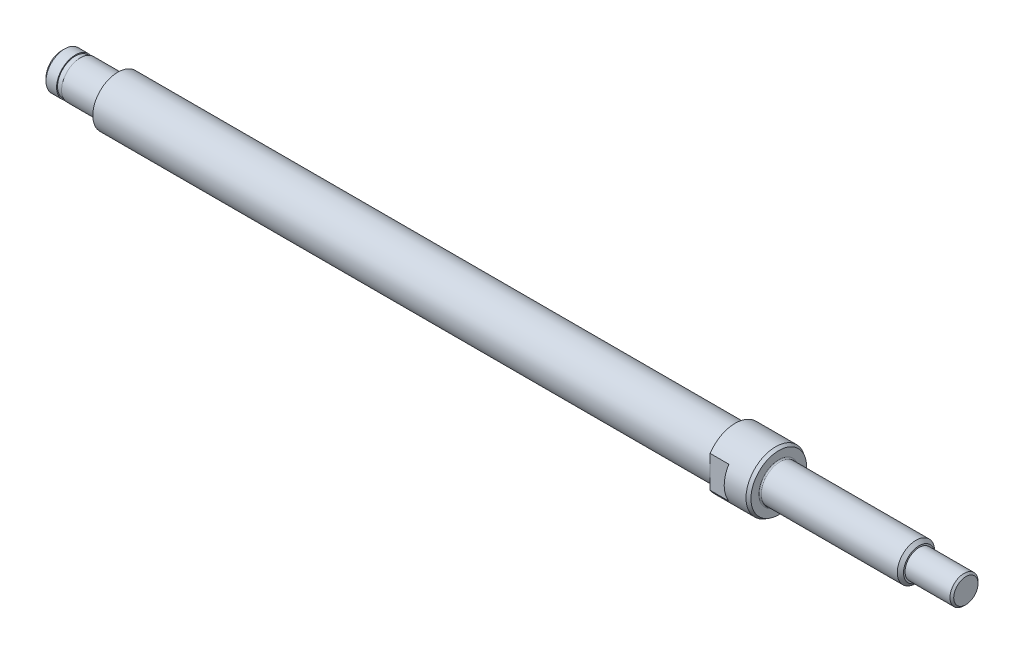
ISO-10303-21;
HEADER;
FILE_DESCRIPTION(('STEP AP214'),'2;1');
FILE_NAME('part.step','',(''),(''),'','','');
FILE_SCHEMA(('AUTOMOTIVE_DESIGN { 1 0 10303 214 1 1 1 1 }'));
ENDSEC;
DATA;
#1=APPLICATION_CONTEXT('core data for automotive mechanical design processes');
#2=APPLICATION_PROTOCOL_DEFINITION('international standard','automotive_design',2000,#1);
#3=PRODUCT_CONTEXT('',#1,'mechanical');
#4=PRODUCT('Part','Part','',(#3));
#5=PRODUCT_RELATED_PRODUCT_CATEGORY('part','',(#4));
#6=PRODUCT_DEFINITION_FORMATION('','',#4);
#7=PRODUCT_DEFINITION_CONTEXT('part definition',#1,'design');
#8=PRODUCT_DEFINITION('design','',#6,#7);
#9=PRODUCT_DEFINITION_SHAPE('','',#8);
#10=(LENGTH_UNIT() NAMED_UNIT(*) SI_UNIT(.MILLI.,.METRE.));
#11=(NAMED_UNIT(*) PLANE_ANGLE_UNIT() SI_UNIT($,.RADIAN.));
#12=(NAMED_UNIT(*) SI_UNIT($,.STERADIAN.) SOLID_ANGLE_UNIT());
#13=UNCERTAINTY_MEASURE_WITH_UNIT(LENGTH_MEASURE(1.E-05),#10,'distance_accuracy_value','');
#14=(GEOMETRIC_REPRESENTATION_CONTEXT(3) GLOBAL_UNCERTAINTY_ASSIGNED_CONTEXT((#13)) GLOBAL_UNIT_ASSIGNED_CONTEXT((#10,
#11,#12)) REPRESENTATION_CONTEXT('',''));
#15=CARTESIAN_POINT('',(0.,0.,0.));
#16=DIRECTION('',(0.,0.,1.));
#17=DIRECTION('',(1.,0.,0.));
#18=AXIS2_PLACEMENT_3D('',#15,#16,#17);
#19=CARTESIAN_POINT('',(136.,0.,0.));
#20=DIRECTION('',(-1.,0.,0.));
#21=DIRECTION('',(0.,0.,1.));
#22=AXIS2_PLACEMENT_3D('',#19,#20,#21);
#23=CYLINDRICAL_SURFACE('',#22,4.75);
#24=CARTESIAN_POINT('',(105.5,0.,0.));
#25=DIRECTION('',(-1.,0.,0.));
#26=DIRECTION('',(0.,0.,1.));
#27=AXIS2_PLACEMENT_3D('',#24,#25,#26);
#28=CIRCLE('',#27,4.75);
#29=CARTESIAN_POINT('',(105.5,0.,4.75));
#30=VERTEX_POINT('',#29);
#31=EDGE_CURVE('E104',#30,#30,#28,.T.);
#32=ORIENTED_EDGE('',*,*,#31,.T.);
#33=EDGE_LOOP('',(#32));
#34=FACE_BOUND('',#33,.T.);
#35=DIRECTION('',(-1.,0.,0.));
#36=VECTOR('',#35,1.);
#37=CARTESIAN_POINT('',(136.,-2.5617376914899,-4.));
#38=LINE('',#37,#36);
#39=CARTESIAN_POINT('',(102.,-2.5617376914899,-4.));
#40=VERTEX_POINT('',#39);
#41=CARTESIAN_POINT('',(99.,-2.5617376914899,-4.));
#42=VERTEX_POINT('',#41);
#43=EDGE_CURVE('E78',#40,#42,#38,.T.);
#44=ORIENTED_EDGE('',*,*,#43,.F.);
#45=CARTESIAN_POINT('',(102.,0.,0.));
#46=DIRECTION('',(1.,0.,0.));
#47=DIRECTION('',(0.,0.,-1.));
#48=AXIS2_PLACEMENT_3D('',#45,#46,#47);
#49=CIRCLE('',#48,4.75);
#50=CARTESIAN_POINT('',(102.,2.5617376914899,-4.));
#51=VERTEX_POINT('',#50);
#52=EDGE_CURVE('E11',#40,#51,#49,.T.);
#53=ORIENTED_EDGE('',*,*,#52,.T.);
#54=DIRECTION('',(-1.,0.,0.));
#55=VECTOR('',#54,1.);
#56=CARTESIAN_POINT('',(136.,2.5617376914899,-4.));
#57=LINE('',#56,#55);
#58=CARTESIAN_POINT('',(99.,2.5617376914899,-4.));
#59=VERTEX_POINT('',#58);
#60=EDGE_CURVE('E85',#59,#51,#57,.F.);
#61=ORIENTED_EDGE('',*,*,#60,.F.);
#62=CARTESIAN_POINT('',(99.,0.,0.));
#63=DIRECTION('',(-1.,0.,0.));
#64=DIRECTION('',(0.,0.,1.));
#65=AXIS2_PLACEMENT_3D('',#62,#63,#64);
#66=CIRCLE('',#65,4.75);
#67=CARTESIAN_POINT('',(99.,2.5617376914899,4.));
#68=VERTEX_POINT('',#67);
#69=EDGE_CURVE('E100',#68,#59,#66,.T.);
#70=ORIENTED_EDGE('',*,*,#69,.F.);
#71=DIRECTION('',(-1.,0.,0.));
#72=VECTOR('',#71,1.);
#73=CARTESIAN_POINT('',(136.,2.5617376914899,4.));
#74=LINE('',#73,#72);
#75=CARTESIAN_POINT('',(102.,2.5617376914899,4.));
#76=VERTEX_POINT('',#75);
#77=EDGE_CURVE('E139',#76,#68,#74,.T.);
#78=ORIENTED_EDGE('',*,*,#77,.F.);
#79=CARTESIAN_POINT('',(102.,-2.5617376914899,4.));
#80=VERTEX_POINT('',#79);
#81=EDGE_CURVE('E36',#76,#80,#49,.T.);
#82=ORIENTED_EDGE('',*,*,#81,.T.);
#83=DIRECTION('',(-1.,0.,0.));
#84=VECTOR('',#83,1.);
#85=CARTESIAN_POINT('',(136.,-2.5617376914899,4.));
#86=LINE('',#85,#84);
#87=CARTESIAN_POINT('',(99.,-2.5617376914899,4.));
#88=VERTEX_POINT('',#87);
#89=EDGE_CURVE('E95',#88,#80,#86,.F.);
#90=ORIENTED_EDGE('',*,*,#89,.F.);
#91=EDGE_CURVE('E91',#42,#88,#66,.T.);
#92=ORIENTED_EDGE('',*,*,#91,.F.);
#93=EDGE_LOOP('',(#44,#53,#61,#70,#78,#82,#90,#92));
#94=FACE_BOUND('',#93,.T.);
#95=ADVANCED_FACE('F32',(#34,#94),#23,.T.);
#96=CARTESIAN_POINT('',(99.,4.,0.));
#97=DIRECTION('',(1.,0.,0.));
#98=DIRECTION('',(0.,0.,-1.));
#99=AXIS2_PLACEMENT_3D('',#96,#97,#98);
#100=PLANE('',#99);
#101=DIRECTION('',(0.,1.,0.));
#102=VECTOR('',#101,1.);
#103=CARTESIAN_POINT('',(99.,-4.85,-4.));
#104=LINE('',#103,#102);
#105=CARTESIAN_POINT('',(99.,0.,-4.));
#106=VERTEX_POINT('',#105);
#107=EDGE_CURVE('E47',#42,#106,#104,.T.);
#108=ORIENTED_EDGE('',*,*,#107,.F.);
#109=ORIENTED_EDGE('',*,*,#91,.T.);
#110=DIRECTION('',(0.,-1.,0.));
#111=VECTOR('',#110,1.);
#112=CARTESIAN_POINT('',(99.,4.85,4.));
#113=LINE('',#112,#111);
#114=CARTESIAN_POINT('',(99.,0.,4.));
#115=VERTEX_POINT('',#114);
#116=EDGE_CURVE('E147',#115,#88,#113,.T.);
#117=ORIENTED_EDGE('',*,*,#116,.F.);
#118=CARTESIAN_POINT('',(99.,0.,0.));
#119=DIRECTION('',(-1.,0.,0.));
#120=DIRECTION('',(0.,0.,1.));
#121=AXIS2_PLACEMENT_3D('',#118,#119,#120);
#122=CIRCLE('',#121,4.);
#123=EDGE_CURVE('E93',#106,#115,#122,.T.);
#124=ORIENTED_EDGE('',*,*,#123,.F.);
#125=EDGE_LOOP('',(#108,#109,#117,#124));
#126=FACE_BOUND('',#125,.T.);
#127=ADVANCED_FACE('F90',(#126),#100,.F.);
#128=EDGE_CURVE('E96',#106,#59,#104,.T.);
#129=ORIENTED_EDGE('',*,*,#128,.F.);
#130=EDGE_CURVE('E101',#115,#106,#122,.T.);
#131=ORIENTED_EDGE('',*,*,#130,.F.);
#132=EDGE_CURVE('E55',#68,#115,#113,.T.);
#133=ORIENTED_EDGE('',*,*,#132,.F.);
#134=ORIENTED_EDGE('',*,*,#69,.T.);
#135=EDGE_LOOP('',(#129,#131,#133,#134));
#136=FACE_BOUND('',#135,.T.);
#137=ADVANCED_FACE('F181',(#136),#100,.F.);
#138=CARTESIAN_POINT('',(0.,0.,0.));
#139=DIRECTION('',(1.,0.,0.));
#140=DIRECTION('',(0.,0.,-1.));
#141=AXIS2_PLACEMENT_3D('',#138,#139,#140);
#142=PLANE('',#141);
#143=CARTESIAN_POINT('',(0.,0.,0.));
#144=DIRECTION('',(-1.,0.,0.));
#145=DIRECTION('',(0.,0.,1.));
#146=AXIS2_PLACEMENT_3D('',#143,#144,#145);
#147=CIRCLE('',#146,4.);
#148=CARTESIAN_POINT('',(0.,0.,4.));
#149=VERTEX_POINT('',#148);
#150=EDGE_CURVE('E173',#149,#149,#147,.T.);
#151=ORIENTED_EDGE('',*,*,#150,.T.);
#152=EDGE_LOOP('',(#151));
#153=FACE_BOUND('',#152,.T.);
#154=CARTESIAN_POINT('',(0.,0.,0.));
#155=DIRECTION('',(-1.,0.,0.));
#156=DIRECTION('',(0.,0.,1.));
#157=AXIS2_PLACEMENT_3D('',#154,#155,#156);
#158=CIRCLE('',#157,3.20000000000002);
#159=CARTESIAN_POINT('',(0.,0.,3.20000000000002));
#160=VERTEX_POINT('',#159);
#161=EDGE_CURVE('E133',#160,#160,#158,.T.);
#162=ORIENTED_EDGE('',*,*,#161,.F.);
#163=EDGE_LOOP('',(#162));
#164=FACE_BOUND('',#163,.T.);
#165=ADVANCED_FACE('F236',(#153,#164),#142,.F.);
#166=CARTESIAN_POINT('',(136.,1.95,0.));
#167=DIRECTION('',(-1.,0.,0.));
#168=DIRECTION('',(0.,0.,1.));
#169=AXIS2_PLACEMENT_3D('',#166,#167,#168);
#170=PLANE('',#169);
#171=CARTESIAN_POINT('',(136.,0.,0.));
#172=DIRECTION('',(-1.,0.,0.));
#173=DIRECTION('',(0.,0.,1.));
#174=AXIS2_PLACEMENT_3D('',#171,#172,#173);
#175=CIRCLE('',#174,1.95);
#176=CARTESIAN_POINT('',(136.,0.,1.95));
#177=VERTEX_POINT('',#176);
#178=EDGE_CURVE('E131',#177,#177,#175,.T.);
#179=ORIENTED_EDGE('',*,*,#178,.F.);
#180=EDGE_LOOP('',(#179));
#181=FACE_BOUND('',#180,.T.);
#182=ADVANCED_FACE('F34',(#181),#170,.F.);
#183=CARTESIAN_POINT('',(136.,0.,0.));
#184=DIRECTION('',(-1.,0.,0.));
#185=DIRECTION('',(0.,0.,1.));
#186=AXIS2_PLACEMENT_3D('',#183,#184,#185);
#187=CONICAL_SURFACE('',#186,1.95,0.785398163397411);
#188=CARTESIAN_POINT('',(135.7,0.,0.));
#189=DIRECTION('',(-1.,0.,0.));
#190=DIRECTION('',(0.,0.,1.));
#191=AXIS2_PLACEMENT_3D('',#188,#189,#190);
#192=CIRCLE('',#191,2.25);
#193=CARTESIAN_POINT('',(135.7,0.,2.25));
#194=VERTEX_POINT('',#193);
#195=EDGE_CURVE('E128',#194,#194,#192,.T.);
#196=ORIENTED_EDGE('',*,*,#195,.F.);
#197=EDGE_LOOP('',(#196));
#198=FACE_BOUND('',#197,.T.);
#199=ORIENTED_EDGE('',*,*,#178,.T.);
#200=EDGE_LOOP('',(#199));
#201=FACE_BOUND('',#200,.T.);
#202=ADVANCED_FACE('F229',(#198,#201),#187,.T.);
#203=CARTESIAN_POINT('',(136.,0.,0.));
#204=DIRECTION('',(-1.,0.,0.));
#205=DIRECTION('',(0.,0.,1.));
#206=AXIS2_PLACEMENT_3D('',#203,#204,#205);
#207=CYLINDRICAL_SURFACE('',#206,2.25);
#208=CARTESIAN_POINT('',(128.5,0.,0.));
#209=DIRECTION('',(-1.,0.,0.));
#210=DIRECTION('',(0.,0.,1.));
#211=AXIS2_PLACEMENT_3D('',#208,#209,#210);
#212=CIRCLE('',#211,2.25);
#213=CARTESIAN_POINT('',(128.5,0.,2.25));
#214=VERTEX_POINT('',#213);
#215=EDGE_CURVE('E125',#214,#214,#212,.T.);
#216=ORIENTED_EDGE('',*,*,#215,.F.);
#217=EDGE_LOOP('',(#216));
#218=FACE_BOUND('',#217,.T.);
#219=ORIENTED_EDGE('',*,*,#195,.T.);
#220=EDGE_LOOP('',(#219));
#221=FACE_BOUND('',#220,.T.);
#222=ADVANCED_FACE('F226',(#218,#221),#207,.T.);
#223=CARTESIAN_POINT('',(128.5,2.5,0.));
#224=DIRECTION('',(-1.,0.,0.));
#225=DIRECTION('',(0.,0.,1.));
#226=AXIS2_PLACEMENT_3D('',#223,#224,#225);
#227=PLANE('',#226);
#228=CARTESIAN_POINT('',(128.5,0.,0.));
#229=DIRECTION('',(-1.,0.,0.));
#230=DIRECTION('',(0.,0.,1.));
#231=AXIS2_PLACEMENT_3D('',#228,#229,#230);
#232=CIRCLE('',#231,2.5);
#233=CARTESIAN_POINT('',(128.5,0.,2.5));
#234=VERTEX_POINT('',#233);
#235=EDGE_CURVE('E122',#234,#234,#232,.T.);
#236=ORIENTED_EDGE('',*,*,#235,.F.);
#237=EDGE_LOOP('',(#236));
#238=FACE_BOUND('',#237,.T.);
#239=ORIENTED_EDGE('',*,*,#215,.T.);
#240=EDGE_LOOP('',(#239));
#241=FACE_BOUND('',#240,.T.);
#242=ADVANCED_FACE('F222',(#238,#241),#227,.F.);
#243=CARTESIAN_POINT('',(128.5,0.,0.));
#244=DIRECTION('',(-1.,0.,0.));
#245=DIRECTION('',(0.,0.,1.));
#246=AXIS2_PLACEMENT_3D('',#243,#244,#245);
#247=CONICAL_SURFACE('',#246,2.5,0.785398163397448);
#248=CARTESIAN_POINT('',(128.,0.,0.));
#249=DIRECTION('',(-1.,0.,0.));
#250=DIRECTION('',(0.,0.,1.));
#251=AXIS2_PLACEMENT_3D('',#248,#249,#250);
#252=CIRCLE('',#251,3.);
#253=CARTESIAN_POINT('',(128.,0.,3.));
#254=VERTEX_POINT('',#253);
#255=EDGE_CURVE('E119',#254,#254,#252,.T.);
#256=ORIENTED_EDGE('',*,*,#255,.F.);
#257=EDGE_LOOP('',(#256));
#258=FACE_BOUND('',#257,.T.);
#259=ORIENTED_EDGE('',*,*,#235,.T.);
#260=EDGE_LOOP('',(#259));
#261=FACE_BOUND('',#260,.T.);
#262=ADVANCED_FACE('F218',(#258,#261),#247,.T.);
#263=CARTESIAN_POINT('',(136.,0.,0.));
#264=DIRECTION('',(-1.,0.,0.));
#265=DIRECTION('',(0.,0.,1.));
#266=AXIS2_PLACEMENT_3D('',#263,#264,#265);
#267=CYLINDRICAL_SURFACE('',#266,3.);
#268=CARTESIAN_POINT('',(106.2,0.,0.));
#269=DIRECTION('',(-1.,0.,0.));
#270=DIRECTION('',(0.,0.,1.));
#271=AXIS2_PLACEMENT_3D('',#268,#269,#270);
#272=CIRCLE('',#271,3.);
#273=CARTESIAN_POINT('',(106.2,0.,3.));
#274=VERTEX_POINT('',#273);
#275=EDGE_CURVE('E116',#274,#274,#272,.T.);
#276=ORIENTED_EDGE('',*,*,#275,.F.);
#277=EDGE_LOOP('',(#276));
#278=FACE_BOUND('',#277,.T.);
#279=ORIENTED_EDGE('',*,*,#255,.T.);
#280=EDGE_LOOP('',(#279));
#281=FACE_BOUND('',#280,.T.);
#282=ADVANCED_FACE('F214',(#278,#281),#267,.T.);
#283=CARTESIAN_POINT('',(106.199999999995,0.,0.));
#284=DIRECTION('',(-1.,0.,0.));
#285=DIRECTION('',(0.,0.,1.));
#286=AXIS2_PLACEMENT_3D('',#283,#284,#285);
#287=TOROIDAL_SURFACE('',#286,3.19999999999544,0.19999999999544);
#288=CARTESIAN_POINT('',(106.,0.,0.));
#289=DIRECTION('',(-1.,0.,0.));
#290=DIRECTION('',(0.,0.,1.));
#291=AXIS2_PLACEMENT_3D('',#288,#289,#290);
#292=CIRCLE('',#291,3.2);
#293=CARTESIAN_POINT('',(106.,0.,3.2));
#294=VERTEX_POINT('',#293);
#295=EDGE_CURVE('E113',#294,#294,#292,.T.);
#296=ORIENTED_EDGE('',*,*,#295,.F.);
#297=EDGE_LOOP('',(#296));
#298=FACE_BOUND('',#297,.T.);
#299=ORIENTED_EDGE('',*,*,#275,.T.);
#300=EDGE_LOOP('',(#299));
#301=FACE_BOUND('',#300,.T.);
#302=ADVANCED_FACE('F210',(#298,#301),#287,.F.);
#303=CARTESIAN_POINT('',(106.,4.4613248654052,0.));
#304=DIRECTION('',(-1.,0.,0.));
#305=DIRECTION('',(0.,0.,1.));
#306=AXIS2_PLACEMENT_3D('',#303,#304,#305);
#307=PLANE('',#306);
#308=CARTESIAN_POINT('',(106.,0.,0.));
#309=DIRECTION('',(-1.,0.,0.));
#310=DIRECTION('',(0.,0.,1.));
#311=AXIS2_PLACEMENT_3D('',#308,#309,#310);
#312=CIRCLE('',#311,4.4613248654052);
#313=CARTESIAN_POINT('',(106.,0.,4.4613248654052));
#314=VERTEX_POINT('',#313);
#315=EDGE_CURVE('E110',#314,#314,#312,.T.);
#316=ORIENTED_EDGE('',*,*,#315,.F.);
#317=EDGE_LOOP('',(#316));
#318=FACE_BOUND('',#317,.T.);
#319=ORIENTED_EDGE('',*,*,#295,.T.);
#320=EDGE_LOOP('',(#319));
#321=FACE_BOUND('',#320,.T.);
#322=ADVANCED_FACE('F206',(#318,#321),#307,.F.);
#323=CARTESIAN_POINT('',(106.,0.,0.));
#324=DIRECTION('',(-1.,0.,0.));
#325=DIRECTION('',(0.,0.,1.));
#326=AXIS2_PLACEMENT_3D('',#323,#324,#325);
#327=CONICAL_SURFACE('',#326,4.4613248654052,0.523598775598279);
#328=ORIENTED_EDGE('',*,*,#31,.F.);
#329=EDGE_LOOP('',(#328));
#330=FACE_BOUND('',#329,.T.);
#331=ORIENTED_EDGE('',*,*,#315,.T.);
#332=EDGE_LOOP('',(#331));
#333=FACE_BOUND('',#332,.T.);
#334=ADVANCED_FACE('F203',(#330,#333),#327,.T.);
#335=CARTESIAN_POINT('',(136.,0.,0.));
#336=DIRECTION('',(-1.,0.,0.));
#337=DIRECTION('',(0.,0.,1.));
#338=AXIS2_PLACEMENT_3D('',#335,#336,#337);
#339=CYLINDRICAL_SURFACE('',#338,4.);
#340=ORIENTED_EDGE('',*,*,#150,.F.);
#341=EDGE_LOOP('',(#340));
#342=FACE_BOUND('',#341,.T.);
#343=ORIENTED_EDGE('',*,*,#130,.T.);
#344=ORIENTED_EDGE('',*,*,#123,.T.);
#345=EDGE_LOOP('',(#343,#344));
#346=FACE_BOUND('',#345,.T.);
#347=ADVANCED_FACE('F179',(#342,#346),#339,.T.);
#348=CARTESIAN_POINT('',(-0.200000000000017,0.,0.));
#349=DIRECTION('',(-1.,0.,0.));
#350=DIRECTION('',(0.,0.,1.));
#351=AXIS2_PLACEMENT_3D('',#348,#349,#350);
#352=TOROIDAL_SURFACE('',#351,3.20000000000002,0.200000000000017);
#353=CARTESIAN_POINT('',(-0.2,0.,0.));
#354=DIRECTION('',(-1.,0.,0.));
#355=DIRECTION('',(0.,0.,1.));
#356=AXIS2_PLACEMENT_3D('',#353,#354,#355);
#357=CIRCLE('',#356,3.);
#358=CARTESIAN_POINT('',(-0.2,0.,3.));
#359=VERTEX_POINT('',#358);
#360=EDGE_CURVE('E171',#359,#359,#357,.T.);
#361=ORIENTED_EDGE('',*,*,#360,.F.);
#362=EDGE_LOOP('',(#361));
#363=FACE_BOUND('',#362,.T.);
#364=ORIENTED_EDGE('',*,*,#161,.T.);
#365=EDGE_LOOP('',(#364));
#366=FACE_BOUND('',#365,.T.);
#367=ADVANCED_FACE('F251',(#363,#366),#352,.F.);
#368=CARTESIAN_POINT('',(0.,0.,0.));
#369=DIRECTION('',(-1.,0.,0.));
#370=DIRECTION('',(0.,0.,1.));
#371=AXIS2_PLACEMENT_3D('',#368,#369,#370);
#372=CYLINDRICAL_SURFACE('',#371,3.);
#373=CARTESIAN_POINT('',(-6.,0.,0.));
#374=DIRECTION('',(-1.,0.,0.));
#375=DIRECTION('',(0.,0.,1.));
#376=AXIS2_PLACEMENT_3D('',#373,#374,#375);
#377=CIRCLE('',#376,3.);
#378=CARTESIAN_POINT('',(-6.,0.,3.));
#379=VERTEX_POINT('',#378);
#380=EDGE_CURVE('E168',#379,#379,#377,.T.);
#381=ORIENTED_EDGE('',*,*,#380,.F.);
#382=EDGE_LOOP('',(#381));
#383=FACE_BOUND('',#382,.T.);
#384=ORIENTED_EDGE('',*,*,#360,.T.);
#385=EDGE_LOOP('',(#384));
#386=FACE_BOUND('',#385,.T.);
#387=ADVANCED_FACE('F258',(#383,#386),#372,.T.);
#388=CARTESIAN_POINT('',(-6.,2.85,0.));
#389=DIRECTION('',(1.,0.,0.));
#390=DIRECTION('',(0.,0.,-1.));
#391=AXIS2_PLACEMENT_3D('',#388,#389,#390);
#392=PLANE('',#391);
#393=CARTESIAN_POINT('',(-6.,0.,0.));
#394=DIRECTION('',(-1.,0.,0.));
#395=DIRECTION('',(0.,0.,1.));
#396=AXIS2_PLACEMENT_3D('',#393,#394,#395);
#397=CIRCLE('',#396,2.85);
#398=CARTESIAN_POINT('',(-6.,0.,2.85));
#399=VERTEX_POINT('',#398);
#400=EDGE_CURVE('E165',#399,#399,#397,.T.);
#401=ORIENTED_EDGE('',*,*,#400,.F.);
#402=EDGE_LOOP('',(#401));
#403=FACE_BOUND('',#402,.T.);
#404=ORIENTED_EDGE('',*,*,#380,.T.);
#405=EDGE_LOOP('',(#404));
#406=FACE_BOUND('',#405,.T.);
#407=ADVANCED_FACE('F263',(#403,#406),#392,.F.);
#408=CARTESIAN_POINT('',(0.,0.,0.));
#409=DIRECTION('',(-1.,0.,0.));
#410=DIRECTION('',(0.,0.,1.));
#411=AXIS2_PLACEMENT_3D('',#408,#409,#410);
#412=CYLINDRICAL_SURFACE('',#411,2.85);
#413=CARTESIAN_POINT('',(-6.8,0.,0.));
#414=DIRECTION('',(-1.,0.,0.));
#415=DIRECTION('',(0.,0.,1.));
#416=AXIS2_PLACEMENT_3D('',#413,#414,#415);
#417=CIRCLE('',#416,2.85);
#418=CARTESIAN_POINT('',(-6.8,0.,2.85));
#419=VERTEX_POINT('',#418);
#420=EDGE_CURVE('E162',#419,#419,#417,.T.);
#421=ORIENTED_EDGE('',*,*,#420,.F.);
#422=EDGE_LOOP('',(#421));
#423=FACE_BOUND('',#422,.T.);
#424=ORIENTED_EDGE('',*,*,#400,.T.);
#425=EDGE_LOOP('',(#424));
#426=FACE_BOUND('',#425,.T.);
#427=ADVANCED_FACE('F270',(#423,#426),#412,.T.);
#428=CARTESIAN_POINT('',(-6.8,3.,0.));
#429=DIRECTION('',(-1.,0.,0.));
#430=DIRECTION('',(0.,0.,1.));
#431=AXIS2_PLACEMENT_3D('',#428,#429,#430);
#432=PLANE('',#431);
#433=CARTESIAN_POINT('',(-6.8,0.,0.));
#434=DIRECTION('',(-1.,0.,0.));
#435=DIRECTION('',(0.,0.,1.));
#436=AXIS2_PLACEMENT_3D('',#433,#434,#435);
#437=CIRCLE('',#436,3.);
#438=CARTESIAN_POINT('',(-6.8,0.,3.));
#439=VERTEX_POINT('',#438);
#440=EDGE_CURVE('E159',#439,#439,#437,.T.);
#441=ORIENTED_EDGE('',*,*,#440,.F.);
#442=EDGE_LOOP('',(#441));
#443=FACE_BOUND('',#442,.T.);
#444=ORIENTED_EDGE('',*,*,#420,.T.);
#445=EDGE_LOOP('',(#444));
#446=FACE_BOUND('',#445,.T.);
#447=ADVANCED_FACE('F277',(#443,#446),#432,.F.);
#448=CARTESIAN_POINT('',(0.,0.,0.));
#449=DIRECTION('',(-1.,0.,0.));
#450=DIRECTION('',(0.,0.,1.));
#451=AXIS2_PLACEMENT_3D('',#448,#449,#450);
#452=CYLINDRICAL_SURFACE('',#451,3.);
#453=CARTESIAN_POINT('',(-8.5,0.,0.));
#454=DIRECTION('',(-1.,0.,0.));
#455=DIRECTION('',(0.,0.,1.));
#456=AXIS2_PLACEMENT_3D('',#453,#454,#455);
#457=CIRCLE('',#456,3.);
#458=CARTESIAN_POINT('',(-8.5,0.,3.));
#459=VERTEX_POINT('',#458);
#460=EDGE_CURVE('E156',#459,#459,#457,.T.);
#461=ORIENTED_EDGE('',*,*,#460,.F.);
#462=EDGE_LOOP('',(#461));
#463=FACE_BOUND('',#462,.T.);
#464=ORIENTED_EDGE('',*,*,#440,.T.);
#465=EDGE_LOOP('',(#464));
#466=FACE_BOUND('',#465,.T.);
#467=ADVANCED_FACE('F281',(#463,#466),#452,.T.);
#468=CARTESIAN_POINT('',(-8.5,0.,0.));
#469=DIRECTION('',(1.,0.,0.));
#470=DIRECTION('',(0.,0.,-1.));
#471=AXIS2_PLACEMENT_3D('',#468,#469,#470);
#472=CONICAL_SURFACE('',#471,3.,0.78539816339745);
#473=CARTESIAN_POINT('',(-9.,0.,0.));
#474=DIRECTION('',(-1.,0.,0.));
#475=DIRECTION('',(0.,0.,1.));
#476=AXIS2_PLACEMENT_3D('',#473,#474,#475);
#477=CIRCLE('',#476,2.5);
#478=CARTESIAN_POINT('',(-9.,0.,2.5));
#479=VERTEX_POINT('',#478);
#480=EDGE_CURVE('E84',#479,#479,#477,.T.);
#481=ORIENTED_EDGE('',*,*,#480,.F.);
#482=EDGE_LOOP('',(#481));
#483=FACE_BOUND('',#482,.T.);
#484=ORIENTED_EDGE('',*,*,#460,.T.);
#485=EDGE_LOOP('',(#484));
#486=FACE_BOUND('',#485,.T.);
#487=ADVANCED_FACE('F285',(#483,#486),#472,.T.);
#488=CARTESIAN_POINT('',(-9.,0.,0.));
#489=DIRECTION('',(1.,0.,0.));
#490=DIRECTION('',(0.,0.,-1.));
#491=AXIS2_PLACEMENT_3D('',#488,#489,#490);
#492=PLANE('',#491);
#493=ORIENTED_EDGE('',*,*,#480,.T.);
#494=EDGE_LOOP('',(#493));
#495=FACE_BOUND('',#494,.T.);
#496=ADVANCED_FACE('F288',(#495),#492,.F.);
#497=CARTESIAN_POINT('',(99.,4.85,4.));
#498=DIRECTION('',(0.,0.,1.));
#499=DIRECTION('',(1.,0.,0.));
#500=AXIS2_PLACEMENT_3D('',#497,#498,#499);
#501=PLANE('',#500);
#502=ORIENTED_EDGE('',*,*,#77,.T.);
#503=ORIENTED_EDGE('',*,*,#132,.T.);
#504=ORIENTED_EDGE('',*,*,#116,.T.);
#505=ORIENTED_EDGE('',*,*,#89,.T.);
#506=DIRECTION('',(0.,-1.,0.));
#507=VECTOR('',#506,1.);
#508=CARTESIAN_POINT('',(102.,4.85,4.));
#509=LINE('',#508,#507);
#510=EDGE_CURVE('E144',#76,#80,#509,.T.);
#511=ORIENTED_EDGE('',*,*,#510,.F.);
#512=EDGE_LOOP('',(#502,#503,#504,#505,#511));
#513=FACE_BOUND('',#512,.T.);
#514=ADVANCED_FACE('F145',(#513),#501,.T.);
#515=CARTESIAN_POINT('',(102.,0.,0.));
#516=DIRECTION('',(1.,0.,0.));
#517=DIRECTION('',(0.,0.,-1.));
#518=AXIS2_PLACEMENT_3D('',#515,#516,#517);
#519=PLANE('',#518);
#520=ORIENTED_EDGE('',*,*,#510,.T.);
#521=ORIENTED_EDGE('',*,*,#81,.F.);
#522=EDGE_LOOP('',(#520,#521));
#523=FACE_BOUND('',#522,.T.);
#524=ADVANCED_FACE('F143',(#523),#519,.F.);
#525=DIRECTION('',(0.,1.,0.));
#526=VECTOR('',#525,1.);
#527=CARTESIAN_POINT('',(102.,-4.85,-4.));
#528=LINE('',#527,#526);
#529=EDGE_CURVE('E81',#40,#51,#528,.T.);
#530=ORIENTED_EDGE('',*,*,#529,.T.);
#531=ORIENTED_EDGE('',*,*,#52,.F.);
#532=EDGE_LOOP('',(#530,#531));
#533=FACE_BOUND('',#532,.T.);
#534=ADVANCED_FACE('F184',(#533),#519,.F.);
#535=CARTESIAN_POINT('',(99.,-4.85,-4.));
#536=DIRECTION('',(0.,0.,-1.));
#537=DIRECTION('',(-1.,0.,0.));
#538=AXIS2_PLACEMENT_3D('',#535,#536,#537);
#539=PLANE('',#538);
#540=ORIENTED_EDGE('',*,*,#43,.T.);
#541=ORIENTED_EDGE('',*,*,#107,.T.);
#542=ORIENTED_EDGE('',*,*,#128,.T.);
#543=ORIENTED_EDGE('',*,*,#60,.T.);
#544=ORIENTED_EDGE('',*,*,#529,.F.);
#545=EDGE_LOOP('',(#540,#541,#542,#543,#544));
#546=FACE_BOUND('',#545,.T.);
#547=ADVANCED_FACE('F79',(#546),#539,.T.);
#548=CLOSED_SHELL('',(#95,#127,#137,#165,#182,#202,#222,#242,#262,#282,#302,#322,#334,#347,#367,
#387,#407,#427,#447,#467,#487,#496,#514,#524,#534,#547));
#549=MANIFOLD_SOLID_BREP('B2',#548);
#550=ADVANCED_BREP_SHAPE_REPRESENTATION('',(#18,#549),#14);
#551=SHAPE_DEFINITION_REPRESENTATION(#9,#550);
ENDSEC;
END-ISO-10303-21;
